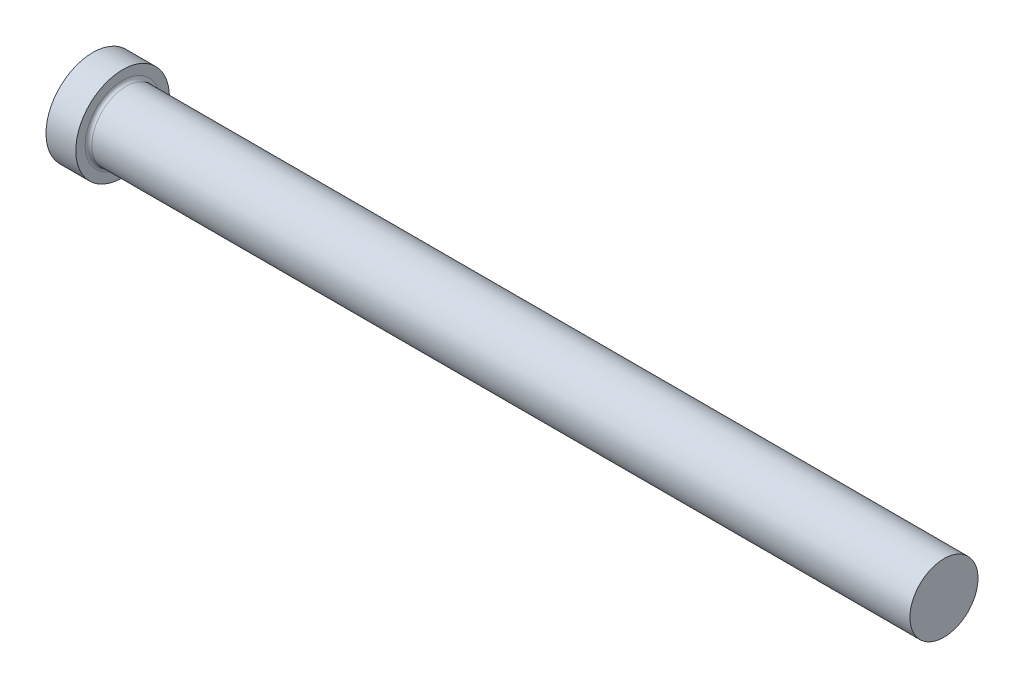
ISO-10303-21;
HEADER;
FILE_DESCRIPTION(('STEP AP214'),'2;1');
FILE_NAME('part.step','',(''),(''),'','','');
FILE_SCHEMA(('AUTOMOTIVE_DESIGN { 1 0 10303 214 1 1 1 1 }'));
ENDSEC;
DATA;
#1=APPLICATION_CONTEXT('core data for automotive mechanical design processes');
#2=APPLICATION_PROTOCOL_DEFINITION('international standard','automotive_design',2000,#1);
#3=PRODUCT_CONTEXT('',#1,'mechanical');
#4=PRODUCT('Part','Part','',(#3));
#5=PRODUCT_RELATED_PRODUCT_CATEGORY('part','',(#4));
#6=PRODUCT_DEFINITION_FORMATION('','',#4);
#7=PRODUCT_DEFINITION_CONTEXT('part definition',#1,'design');
#8=PRODUCT_DEFINITION('design','',#6,#7);
#9=PRODUCT_DEFINITION_SHAPE('','',#8);
#10=(LENGTH_UNIT() NAMED_UNIT(*) SI_UNIT(.MILLI.,.METRE.));
#11=(NAMED_UNIT(*) PLANE_ANGLE_UNIT() SI_UNIT($,.RADIAN.));
#12=(NAMED_UNIT(*) SI_UNIT($,.STERADIAN.) SOLID_ANGLE_UNIT());
#13=UNCERTAINTY_MEASURE_WITH_UNIT(LENGTH_MEASURE(1.E-05),#10,'distance_accuracy_value','');
#14=(GEOMETRIC_REPRESENTATION_CONTEXT(3) GLOBAL_UNCERTAINTY_ASSIGNED_CONTEXT((#13)) GLOBAL_UNIT_ASSIGNED_CONTEXT((#10,
#11,#12)) REPRESENTATION_CONTEXT('',''));
#15=CARTESIAN_POINT('',(0.,0.,0.));
#16=DIRECTION('',(0.,0.,1.));
#17=DIRECTION('',(1.,0.,0.));
#18=AXIS2_PLACEMENT_3D('',#15,#16,#17);
#19=CARTESIAN_POINT('',(0.,0.,0.));
#20=DIRECTION('',(-1.,0.,0.));
#21=DIRECTION('',(0.,-1.,0.));
#22=AXIS2_PLACEMENT_3D('',#19,#20,#21);
#23=PLANE('',#22);
#24=CARTESIAN_POINT('',(0.,0.,0.));
#25=DIRECTION('',(1.,0.,0.));
#26=DIRECTION('',(0.,1.,0.));
#27=AXIS2_PLACEMENT_3D('',#24,#25,#26);
#28=CIRCLE('',#27,11.);
#29=CARTESIAN_POINT('',(0.,11.,0.));
#30=VERTEX_POINT('',#29);
#31=EDGE_CURVE('E25',#30,#30,#28,.T.);
#32=ORIENTED_EDGE('',*,*,#31,.F.);
#33=EDGE_LOOP('',(#32));
#34=FACE_BOUND('',#33,.T.);
#35=ADVANCED_FACE('F14',(#34),#23,.T.);
#36=CARTESIAN_POINT('',(200.,0.,0.));
#37=DIRECTION('',(1.,0.,0.));
#38=DIRECTION('',(0.,1.,0.));
#39=AXIS2_PLACEMENT_3D('',#36,#37,#38);
#40=CYLINDRICAL_SURFACE('',#39,11.);
#41=ORIENTED_EDGE('',*,*,#31,.T.);
#42=EDGE_LOOP('',(#41));
#43=FACE_BOUND('',#42,.T.);
#44=CARTESIAN_POINT('',(7.,0.,0.));
#45=DIRECTION('',(1.,0.,0.));
#46=DIRECTION('',(0.,1.,0.));
#47=AXIS2_PLACEMENT_3D('',#44,#45,#46);
#48=CIRCLE('',#47,11.);
#49=CARTESIAN_POINT('',(7.,11.,0.));
#50=VERTEX_POINT('',#49);
#51=EDGE_CURVE('E29',#50,#50,#48,.T.);
#52=ORIENTED_EDGE('',*,*,#51,.F.);
#53=EDGE_LOOP('',(#52));
#54=FACE_BOUND('',#53,.T.);
#55=ADVANCED_FACE('F51',(#43,#54),#40,.T.);
#56=CARTESIAN_POINT('',(7.,11.,0.));
#57=DIRECTION('',(1.,0.,0.));
#58=DIRECTION('',(0.,1.,0.));
#59=AXIS2_PLACEMENT_3D('',#56,#57,#58);
#60=PLANE('',#59);
#61=CARTESIAN_POINT('',(7.,0.,0.));
#62=DIRECTION('',(1.,0.,0.));
#63=DIRECTION('',(0.,1.,0.));
#64=AXIS2_PLACEMENT_3D('',#61,#62,#63);
#65=CIRCLE('',#64,8.8);
#66=CARTESIAN_POINT('',(7.,8.8,0.));
#67=VERTEX_POINT('',#66);
#68=EDGE_CURVE('E9',#67,#67,#65,.F.);
#69=ORIENTED_EDGE('',*,*,#68,.T.);
#70=EDGE_LOOP('',(#69));
#71=FACE_BOUND('',#70,.T.);
#72=ORIENTED_EDGE('',*,*,#51,.T.);
#73=EDGE_LOOP('',(#72));
#74=FACE_BOUND('',#73,.T.);
#75=ADVANCED_FACE('F42',(#71,#74),#60,.T.);
#76=CARTESIAN_POINT('',(200.,0.,0.));
#77=DIRECTION('',(1.,0.,0.));
#78=DIRECTION('',(0.,1.,0.));
#79=AXIS2_PLACEMENT_3D('',#76,#77,#78);
#80=CYLINDRICAL_SURFACE('',#79,8.);
#81=CARTESIAN_POINT('',(7.8,0.,0.));
#82=DIRECTION('',(1.,0.,0.));
#83=DIRECTION('',(0.,1.,0.));
#84=AXIS2_PLACEMENT_3D('',#81,#82,#83);
#85=CIRCLE('',#84,8.);
#86=CARTESIAN_POINT('',(7.8,8.,0.));
#87=VERTEX_POINT('',#86);
#88=EDGE_CURVE('E21',#87,#87,#85,.T.);
#89=ORIENTED_EDGE('',*,*,#88,.T.);
#90=EDGE_LOOP('',(#89));
#91=FACE_BOUND('',#90,.T.);
#92=CARTESIAN_POINT('',(200.,0.,0.));
#93=DIRECTION('',(1.,0.,0.));
#94=DIRECTION('',(0.,1.,0.));
#95=AXIS2_PLACEMENT_3D('',#92,#93,#94);
#96=CIRCLE('',#95,8.);
#97=CARTESIAN_POINT('',(200.,8.00000000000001,0.));
#98=VERTEX_POINT('',#97);
#99=EDGE_CURVE('E34',#98,#98,#96,.T.);
#100=ORIENTED_EDGE('',*,*,#99,.F.);
#101=EDGE_LOOP('',(#100));
#102=FACE_BOUND('',#101,.T.);
#103=ADVANCED_FACE('F40',(#91,#102),#80,.T.);
#104=CARTESIAN_POINT('',(200.,8.,0.));
#105=DIRECTION('',(1.,0.,0.));
#106=DIRECTION('',(0.,1.,0.));
#107=AXIS2_PLACEMENT_3D('',#104,#105,#106);
#108=PLANE('',#107);
#109=ORIENTED_EDGE('',*,*,#99,.T.);
#110=EDGE_LOOP('',(#109));
#111=FACE_BOUND('',#110,.T.);
#112=ADVANCED_FACE('F38',(#111),#108,.T.);
#113=CARTESIAN_POINT('',(7.8,0.,0.));
#114=DIRECTION('',(1.,0.,0.));
#115=DIRECTION('',(0.,1.,0.));
#116=AXIS2_PLACEMENT_3D('',#113,#114,#115);
#117=TOROIDAL_SURFACE('',#116,8.8,0.8);
#118=ORIENTED_EDGE('',*,*,#68,.F.);
#119=EDGE_LOOP('',(#118));
#120=FACE_BOUND('',#119,.T.);
#121=ORIENTED_EDGE('',*,*,#88,.F.);
#122=EDGE_LOOP('',(#121));
#123=FACE_BOUND('',#122,.T.);
#124=ADVANCED_FACE('F16',(#120,#123),#117,.F.);
#125=CLOSED_SHELL('',(#35,#55,#75,#103,#112,#124));
#126=MANIFOLD_SOLID_BREP('B1',#125);
#127=ADVANCED_BREP_SHAPE_REPRESENTATION('',(#18,#126),#14);
#128=SHAPE_DEFINITION_REPRESENTATION(#9,#127);
ENDSEC;
END-ISO-10303-21;
